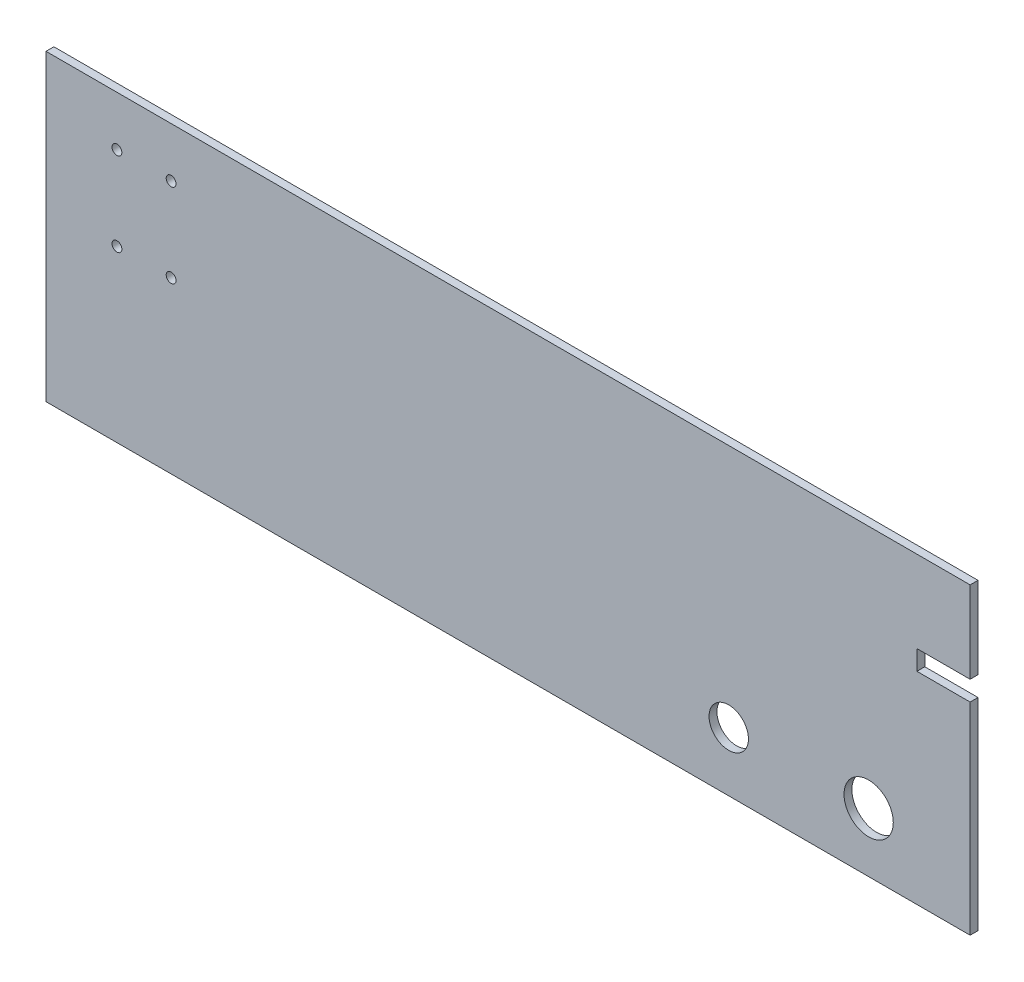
from build123d import *

# Parameters (mm, degrees)
ESQUISSEREF_R    = 20
ESQUISSEREF_R_2  = 5
ESQUISSEREF_R_3  = 25
EXTRUSION1_DEPTH = 8


with BuildPart() as part:
    # EsquisseRef → Extrusion1 (new body)
    with BuildSketch(Plane.XY):
        Polygon((-693, 248), (245, 248), (245, 165), (191, 165), (191, 145), (245, 145), (245, -60), (-693, -60), align=None)
        Circle(ESQUISSEREF_R, mode=Mode.SUBTRACT)
        with Locations((-621, 197.5)):
            Circle(ESQUISSEREF_R_2, mode=Mode.SUBTRACT)
        with Locations(Location((-566, 197.5, 0), (0, 0, 180))):
            Circle(ESQUISSEREF_R_2, mode=Mode.SUBTRACT)
        with Locations((-566, 112.5)):
            Circle(ESQUISSEREF_R_2, mode=Mode.SUBTRACT)
        with Locations(Location((-621, 112.5, 0), (0, 0, 180))):
            Circle(ESQUISSEREF_R_2, mode=Mode.SUBTRACT)
        with Locations((142, 0)):
            Circle(ESQUISSEREF_R_3, mode=Mode.SUBTRACT)
    extrude(amount=-EXTRUSION1_DEPTH)


solid = part.part
